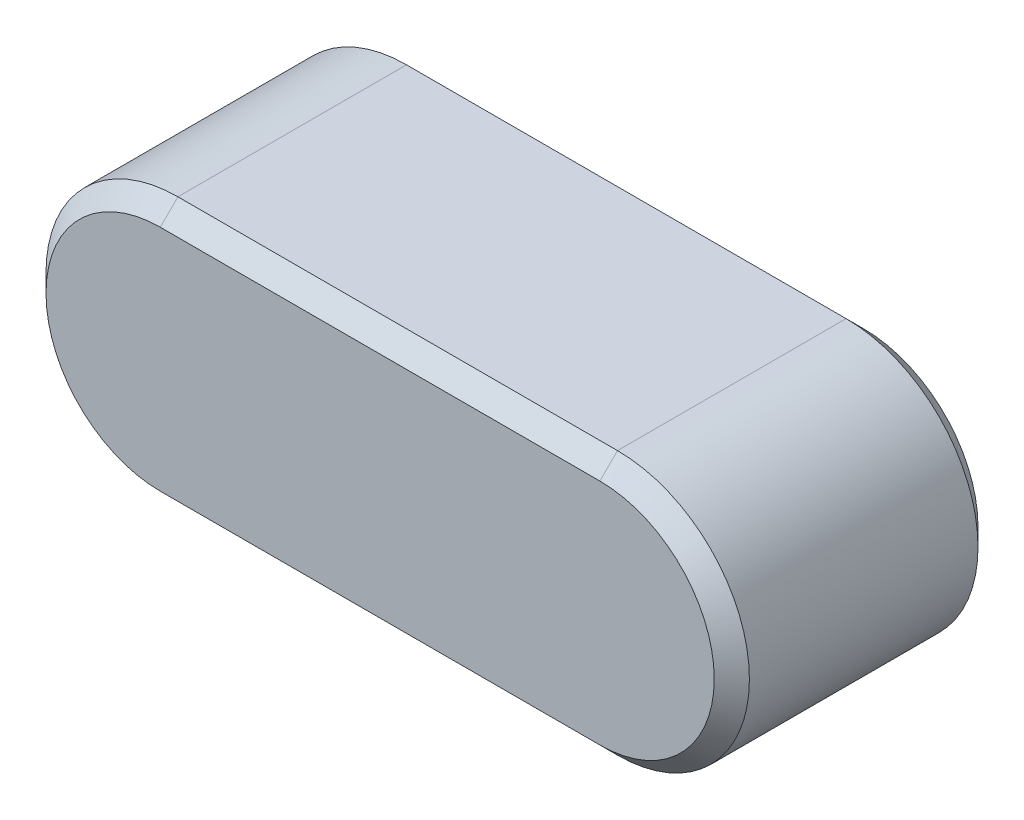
ISO-10303-21;
HEADER;
FILE_DESCRIPTION(('STEP AP214'),'2;1');
FILE_NAME('part.step','',(''),(''),'','','');
FILE_SCHEMA(('AUTOMOTIVE_DESIGN { 1 0 10303 214 1 1 1 1 }'));
ENDSEC;
DATA;
#1=APPLICATION_CONTEXT('core data for automotive mechanical design processes');
#2=APPLICATION_PROTOCOL_DEFINITION('international standard','automotive_design',2000,#1);
#3=PRODUCT_CONTEXT('',#1,'mechanical');
#4=PRODUCT('Part','Part','',(#3));
#5=PRODUCT_RELATED_PRODUCT_CATEGORY('part','',(#4));
#6=PRODUCT_DEFINITION_FORMATION('','',#4);
#7=PRODUCT_DEFINITION_CONTEXT('part definition',#1,'design');
#8=PRODUCT_DEFINITION('design','',#6,#7);
#9=PRODUCT_DEFINITION_SHAPE('','',#8);
#10=(LENGTH_UNIT() NAMED_UNIT(*) SI_UNIT(.MILLI.,.METRE.));
#11=(NAMED_UNIT(*) PLANE_ANGLE_UNIT() SI_UNIT($,.RADIAN.));
#12=(NAMED_UNIT(*) SI_UNIT($,.STERADIAN.) SOLID_ANGLE_UNIT());
#13=UNCERTAINTY_MEASURE_WITH_UNIT(LENGTH_MEASURE(1.E-05),#10,'distance_accuracy_value','');
#14=(GEOMETRIC_REPRESENTATION_CONTEXT(3) GLOBAL_UNCERTAINTY_ASSIGNED_CONTEXT((#13)) GLOBAL_UNIT_ASSIGNED_CONTEXT((#10,
#11,#12)) REPRESENTATION_CONTEXT('',''));
#15=CARTESIAN_POINT('',(0.,0.,0.));
#16=DIRECTION('',(0.,0.,1.));
#17=DIRECTION('',(1.,0.,0.));
#18=AXIS2_PLACEMENT_3D('',#15,#16,#17);
#19=CARTESIAN_POINT('',(-5.,0.,1.5));
#20=DIRECTION('',(0.,0.,-1.));
#21=DIRECTION('',(-1.,0.,0.));
#22=AXIS2_PLACEMENT_3D('',#19,#20,#21);
#23=CYLINDRICAL_SURFACE('',#22,1.5);
#24=DIRECTION('',(0.,0.,-1.));
#25=VECTOR('',#24,1.);
#26=CARTESIAN_POINT('',(-5.,-1.5,1.5));
#27=LINE('',#26,#25);
#28=CARTESIAN_POINT('',(-5.,-1.5,1.3));
#29=VERTEX_POINT('',#28);
#30=CARTESIAN_POINT('',(-5.,-1.5,-1.3));
#31=VERTEX_POINT('',#30);
#32=EDGE_CURVE('E128',#29,#31,#27,.T.);
#33=ORIENTED_EDGE('',*,*,#32,.F.);
#34=CARTESIAN_POINT('',(-5.,0.,1.3));
#35=DIRECTION('',(0.,0.,-1.));
#36=DIRECTION('',(-1.,0.,0.));
#37=AXIS2_PLACEMENT_3D('',#34,#35,#36);
#38=CIRCLE('',#37,1.5);
#39=CARTESIAN_POINT('',(-5.,1.5,1.3));
#40=VERTEX_POINT('',#39);
#41=EDGE_CURVE('E62',#29,#40,#38,.T.);
#42=ORIENTED_EDGE('',*,*,#41,.T.);
#43=DIRECTION('',(0.,0.,-1.));
#44=VECTOR('',#43,1.);
#45=CARTESIAN_POINT('',(-5.,1.5,1.5));
#46=LINE('',#45,#44);
#47=CARTESIAN_POINT('',(-5.,1.5,-1.3));
#48=VERTEX_POINT('',#47);
#49=EDGE_CURVE('E166',#40,#48,#46,.T.);
#50=ORIENTED_EDGE('',*,*,#49,.T.);
#51=CARTESIAN_POINT('',(-5.,0.,-1.3));
#52=DIRECTION('',(0.,0.,-1.));
#53=DIRECTION('',(-1.,0.,0.));
#54=AXIS2_PLACEMENT_3D('',#51,#52,#53);
#55=CIRCLE('',#54,1.5);
#56=EDGE_CURVE('E116',#48,#31,#55,.F.);
#57=ORIENTED_EDGE('',*,*,#56,.T.);
#58=EDGE_LOOP('',(#33,#42,#50,#57));
#59=FACE_BOUND('',#58,.T.);
#60=ADVANCED_FACE('F39',(#59),#23,.T.);
#61=CARTESIAN_POINT('',(0.,-1.5,1.5));
#62=DIRECTION('',(0.,1.,0.));
#63=DIRECTION('',(-1.,0.,0.));
#64=AXIS2_PLACEMENT_3D('',#61,#62,#63);
#65=PLANE('',#64);
#66=ORIENTED_EDGE('',*,*,#32,.T.);
#67=DIRECTION('',(1.,0.,0.));
#68=VECTOR('',#67,1.);
#69=CARTESIAN_POINT('',(0.,-1.5,-1.3));
#70=LINE('',#69,#68);
#71=CARTESIAN_POINT('',(0.,-1.5,-1.3));
#72=VERTEX_POINT('',#71);
#73=EDGE_CURVE('E127',#31,#72,#70,.T.);
#74=ORIENTED_EDGE('',*,*,#73,.T.);
#75=DIRECTION('',(0.,0.,-1.));
#76=VECTOR('',#75,1.);
#77=CARTESIAN_POINT('',(0.,-1.5,1.5));
#78=LINE('',#77,#76);
#79=CARTESIAN_POINT('',(0.,-1.5,1.3));
#80=VERTEX_POINT('',#79);
#81=EDGE_CURVE('E110',#80,#72,#78,.T.);
#82=ORIENTED_EDGE('',*,*,#81,.F.);
#83=DIRECTION('',(-1.,0.,0.));
#84=VECTOR('',#83,1.);
#85=CARTESIAN_POINT('',(0.,-1.5,1.3));
#86=LINE('',#85,#84);
#87=EDGE_CURVE('E125',#80,#29,#86,.T.);
#88=ORIENTED_EDGE('',*,*,#87,.T.);
#89=EDGE_LOOP('',(#66,#74,#82,#88));
#90=FACE_BOUND('',#89,.T.);
#91=ADVANCED_FACE('F124',(#90),#65,.F.);
#92=CARTESIAN_POINT('',(0.,0.,1.5));
#93=DIRECTION('',(0.,0.,-1.));
#94=DIRECTION('',(-1.,0.,0.));
#95=AXIS2_PLACEMENT_3D('',#92,#93,#94);
#96=CYLINDRICAL_SURFACE('',#95,1.5);
#97=DIRECTION('',(0.,0.,-1.));
#98=VECTOR('',#97,1.);
#99=CARTESIAN_POINT('',(0.,1.5,1.5));
#100=LINE('',#99,#98);
#101=CARTESIAN_POINT('',(0.,1.5,1.3));
#102=VERTEX_POINT('',#101);
#103=CARTESIAN_POINT('',(0.,1.5,-1.3));
#104=VERTEX_POINT('',#103);
#105=EDGE_CURVE('E111',#102,#104,#100,.T.);
#106=ORIENTED_EDGE('',*,*,#105,.F.);
#107=CARTESIAN_POINT('',(0.,0.,1.3));
#108=DIRECTION('',(0.,0.,-1.));
#109=DIRECTION('',(-1.,0.,0.));
#110=AXIS2_PLACEMENT_3D('',#107,#108,#109);
#111=CIRCLE('',#110,1.5);
#112=EDGE_CURVE('E107',#102,#80,#111,.T.);
#113=ORIENTED_EDGE('',*,*,#112,.T.);
#114=ORIENTED_EDGE('',*,*,#81,.T.);
#115=CARTESIAN_POINT('',(0.,0.,-1.3));
#116=DIRECTION('',(0.,0.,-1.));
#117=DIRECTION('',(-1.,0.,0.));
#118=AXIS2_PLACEMENT_3D('',#115,#116,#117);
#119=CIRCLE('',#118,1.5);
#120=EDGE_CURVE('E117',#72,#104,#119,.F.);
#121=ORIENTED_EDGE('',*,*,#120,.T.);
#122=EDGE_LOOP('',(#106,#113,#114,#121));
#123=FACE_BOUND('',#122,.T.);
#124=ADVANCED_FACE('F109',(#123),#96,.T.);
#125=CARTESIAN_POINT('',(-5.,1.5,1.5));
#126=DIRECTION('',(0.,-1.,0.));
#127=DIRECTION('',(0.,0.,-1.));
#128=AXIS2_PLACEMENT_3D('',#125,#126,#127);
#129=PLANE('',#128);
#130=ORIENTED_EDGE('',*,*,#49,.F.);
#131=DIRECTION('',(1.,0.,0.));
#132=VECTOR('',#131,1.);
#133=CARTESIAN_POINT('',(-5.,1.5,1.3));
#134=LINE('',#133,#132);
#135=EDGE_CURVE('E11',#40,#102,#134,.T.);
#136=ORIENTED_EDGE('',*,*,#135,.T.);
#137=ORIENTED_EDGE('',*,*,#105,.T.);
#138=DIRECTION('',(-1.,0.,0.));
#139=VECTOR('',#138,1.);
#140=CARTESIAN_POINT('',(-5.,1.5,-1.3));
#141=LINE('',#140,#139);
#142=EDGE_CURVE('E48',#104,#48,#141,.T.);
#143=ORIENTED_EDGE('',*,*,#142,.T.);
#144=EDGE_LOOP('',(#130,#136,#137,#143));
#145=FACE_BOUND('',#144,.T.);
#146=ADVANCED_FACE('F216',(#145),#129,.F.);
#147=CARTESIAN_POINT('',(-5.,0.,1.5));
#148=DIRECTION('',(0.,0.,-1.));
#149=DIRECTION('',(-1.,0.,0.));
#150=AXIS2_PLACEMENT_3D('',#147,#148,#149);
#151=PLANE('',#150);
#152=CARTESIAN_POINT('',(-5.,0.,1.5));
#153=DIRECTION('',(0.,0.,-1.));
#154=DIRECTION('',(-1.,0.,0.));
#155=AXIS2_PLACEMENT_3D('',#152,#153,#154);
#156=CIRCLE('',#155,1.3);
#157=CARTESIAN_POINT('',(-5.,1.3,1.5));
#158=VERTEX_POINT('',#157);
#159=CARTESIAN_POINT('',(-5.,-1.3,1.5));
#160=VERTEX_POINT('',#159);
#161=EDGE_CURVE('E187',#158,#160,#156,.F.);
#162=ORIENTED_EDGE('',*,*,#161,.T.);
#163=DIRECTION('',(1.,0.,0.));
#164=VECTOR('',#163,1.);
#165=CARTESIAN_POINT('',(-5.,-1.3,1.5));
#166=LINE('',#165,#164);
#167=CARTESIAN_POINT('',(0.,-1.3,1.5));
#168=VERTEX_POINT('',#167);
#169=EDGE_CURVE('E190',#160,#168,#166,.T.);
#170=ORIENTED_EDGE('',*,*,#169,.T.);
#171=CARTESIAN_POINT('',(0.,0.,1.5));
#172=DIRECTION('',(0.,0.,-1.));
#173=DIRECTION('',(-1.,0.,0.));
#174=AXIS2_PLACEMENT_3D('',#171,#172,#173);
#175=CIRCLE('',#174,1.3);
#176=CARTESIAN_POINT('',(0.,1.3,1.5));
#177=VERTEX_POINT('',#176);
#178=EDGE_CURVE('E139',#168,#177,#175,.F.);
#179=ORIENTED_EDGE('',*,*,#178,.T.);
#180=DIRECTION('',(-1.,0.,0.));
#181=VECTOR('',#180,1.);
#182=CARTESIAN_POINT('',(-5.,1.3,1.5));
#183=LINE('',#182,#181);
#184=EDGE_CURVE('E185',#177,#158,#183,.T.);
#185=ORIENTED_EDGE('',*,*,#184,.T.);
#186=EDGE_LOOP('',(#162,#170,#179,#185));
#187=FACE_BOUND('',#186,.T.);
#188=ADVANCED_FACE('F219',(#187),#151,.F.);
#189=CARTESIAN_POINT('',(-5.,0.,-1.5));
#190=DIRECTION('',(0.,0.,-1.));
#191=DIRECTION('',(-1.,0.,0.));
#192=AXIS2_PLACEMENT_3D('',#189,#190,#191);
#193=PLANE('',#192);
#194=CARTESIAN_POINT('',(0.,0.,-1.5));
#195=DIRECTION('',(0.,0.,-1.));
#196=DIRECTION('',(-1.,0.,0.));
#197=AXIS2_PLACEMENT_3D('',#194,#195,#196);
#198=CIRCLE('',#197,1.3);
#199=CARTESIAN_POINT('',(0.,1.3,-1.5));
#200=VERTEX_POINT('',#199);
#201=CARTESIAN_POINT('',(0.,-1.3,-1.5));
#202=VERTEX_POINT('',#201);
#203=EDGE_CURVE('E180',#200,#202,#198,.T.);
#204=ORIENTED_EDGE('',*,*,#203,.T.);
#205=DIRECTION('',(-1.,0.,0.));
#206=VECTOR('',#205,1.);
#207=CARTESIAN_POINT('',(-5.,-1.3,-1.5));
#208=LINE('',#207,#206);
#209=CARTESIAN_POINT('',(-5.,-1.3,-1.5));
#210=VERTEX_POINT('',#209);
#211=EDGE_CURVE('E182',#202,#210,#208,.T.);
#212=ORIENTED_EDGE('',*,*,#211,.T.);
#213=CARTESIAN_POINT('',(-5.,0.,-1.5));
#214=DIRECTION('',(0.,0.,-1.));
#215=DIRECTION('',(-1.,0.,0.));
#216=AXIS2_PLACEMENT_3D('',#213,#214,#215);
#217=CIRCLE('',#216,1.3);
#218=CARTESIAN_POINT('',(-5.,1.3,-1.5));
#219=VERTEX_POINT('',#218);
#220=EDGE_CURVE('E178',#210,#219,#217,.T.);
#221=ORIENTED_EDGE('',*,*,#220,.T.);
#222=DIRECTION('',(1.,0.,0.));
#223=VECTOR('',#222,1.);
#224=CARTESIAN_POINT('',(0.,1.3,-1.5));
#225=LINE('',#224,#223);
#226=EDGE_CURVE('E176',#219,#200,#225,.T.);
#227=ORIENTED_EDGE('',*,*,#226,.T.);
#228=EDGE_LOOP('',(#204,#212,#221,#227));
#229=FACE_BOUND('',#228,.T.);
#230=ADVANCED_FACE('F220',(#229),#193,.T.);
#231=CARTESIAN_POINT('',(-5.,1.5,-1.3));
#232=DIRECTION('',(0.,0.707106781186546,-0.707106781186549));
#233=DIRECTION('',(0.,0.707106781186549,0.707106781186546));
#234=AXIS2_PLACEMENT_3D('',#231,#232,#233);
#235=PLANE('',#234);
#236=DIRECTION('',(0.,0.707106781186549,0.707106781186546));
#237=VECTOR('',#236,1.);
#238=CARTESIAN_POINT('',(0.,1.3,-1.5));
#239=LINE('',#238,#237);
#240=EDGE_CURVE('E158',#200,#104,#239,.T.);
#241=ORIENTED_EDGE('',*,*,#240,.F.);
#242=ORIENTED_EDGE('',*,*,#226,.F.);
#243=DIRECTION('',(0.,-0.707106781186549,-0.707106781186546));
#244=VECTOR('',#243,1.);
#245=CARTESIAN_POINT('',(-5.,1.5,-1.3));
#246=LINE('',#245,#244);
#247=EDGE_CURVE('E145',#48,#219,#246,.T.);
#248=ORIENTED_EDGE('',*,*,#247,.F.);
#249=ORIENTED_EDGE('',*,*,#142,.F.);
#250=EDGE_LOOP('',(#241,#242,#248,#249));
#251=FACE_BOUND('',#250,.T.);
#252=ADVANCED_FACE('F223',(#251),#235,.T.);
#253=CARTESIAN_POINT('',(-5.,0.,-1.3));
#254=DIRECTION('',(0.,0.,1.));
#255=DIRECTION('',(1.,0.,0.));
#256=AXIS2_PLACEMENT_3D('',#253,#254,#255);
#257=CONICAL_SURFACE('',#256,1.5,0.78539816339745);
#258=ORIENTED_EDGE('',*,*,#247,.T.);
#259=ORIENTED_EDGE('',*,*,#220,.F.);
#260=DIRECTION('',(0.,0.707106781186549,-0.707106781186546));
#261=VECTOR('',#260,1.);
#262=CARTESIAN_POINT('',(-5.,-1.5,-1.3));
#263=LINE('',#262,#261);
#264=EDGE_CURVE('E152',#31,#210,#263,.T.);
#265=ORIENTED_EDGE('',*,*,#264,.F.);
#266=ORIENTED_EDGE('',*,*,#56,.F.);
#267=EDGE_LOOP('',(#258,#259,#265,#266));
#268=FACE_BOUND('',#267,.T.);
#269=ADVANCED_FACE('F195',(#268),#257,.T.);
#270=CARTESIAN_POINT('',(0.,0.,-1.3));
#271=DIRECTION('',(0.,0.,1.));
#272=DIRECTION('',(1.,0.,0.));
#273=AXIS2_PLACEMENT_3D('',#270,#271,#272);
#274=CONICAL_SURFACE('',#273,1.5,0.78539816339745);
#275=ORIENTED_EDGE('',*,*,#240,.T.);
#276=ORIENTED_EDGE('',*,*,#120,.F.);
#277=DIRECTION('',(0.,-0.707106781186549,0.707106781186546));
#278=VECTOR('',#277,1.);
#279=CARTESIAN_POINT('',(0.,-1.3,-1.5));
#280=LINE('',#279,#278);
#281=EDGE_CURVE('E148',#202,#72,#280,.T.);
#282=ORIENTED_EDGE('',*,*,#281,.F.);
#283=ORIENTED_EDGE('',*,*,#203,.F.);
#284=EDGE_LOOP('',(#275,#276,#282,#283));
#285=FACE_BOUND('',#284,.T.);
#286=ADVANCED_FACE('F198',(#285),#274,.T.);
#287=CARTESIAN_POINT('',(0.,-1.5,-1.3));
#288=DIRECTION('',(0.,-0.707106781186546,-0.707106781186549));
#289=DIRECTION('',(0.,0.707106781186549,-0.707106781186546));
#290=AXIS2_PLACEMENT_3D('',#287,#288,#289);
#291=PLANE('',#290);
#292=ORIENTED_EDGE('',*,*,#264,.T.);
#293=ORIENTED_EDGE('',*,*,#211,.F.);
#294=ORIENTED_EDGE('',*,*,#281,.T.);
#295=ORIENTED_EDGE('',*,*,#73,.F.);
#296=EDGE_LOOP('',(#292,#293,#294,#295));
#297=FACE_BOUND('',#296,.T.);
#298=ADVANCED_FACE('F196',(#297),#291,.T.);
#299=CARTESIAN_POINT('',(-5.,1.3,1.5));
#300=DIRECTION('',(0.,-0.707106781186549,-0.707106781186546));
#301=DIRECTION('',(0.,0.707106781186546,-0.707106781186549));
#302=AXIS2_PLACEMENT_3D('',#299,#300,#301);
#303=PLANE('',#302);
#304=DIRECTION('',(0.,-0.707106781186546,0.707106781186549));
#305=VECTOR('',#304,1.);
#306=CARTESIAN_POINT('',(0.,1.5,1.3));
#307=LINE('',#306,#305);
#308=EDGE_CURVE('E142',#102,#177,#307,.T.);
#309=ORIENTED_EDGE('',*,*,#308,.F.);
#310=ORIENTED_EDGE('',*,*,#135,.F.);
#311=DIRECTION('',(0.,0.707106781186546,-0.707106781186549));
#312=VECTOR('',#311,1.);
#313=CARTESIAN_POINT('',(-5.,1.3,1.5));
#314=LINE('',#313,#312);
#315=EDGE_CURVE('E43',#158,#40,#314,.T.);
#316=ORIENTED_EDGE('',*,*,#315,.F.);
#317=ORIENTED_EDGE('',*,*,#184,.F.);
#318=EDGE_LOOP('',(#309,#310,#316,#317));
#319=FACE_BOUND('',#318,.T.);
#320=ADVANCED_FACE('F41',(#319),#303,.F.);
#321=CARTESIAN_POINT('',(-5.,0.,1.5));
#322=DIRECTION('',(0.,0.,-1.));
#323=DIRECTION('',(-1.,0.,0.));
#324=AXIS2_PLACEMENT_3D('',#321,#322,#323);
#325=CONICAL_SURFACE('',#324,1.3,0.785398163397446);
#326=ORIENTED_EDGE('',*,*,#315,.T.);
#327=ORIENTED_EDGE('',*,*,#41,.F.);
#328=DIRECTION('',(0.,-0.707106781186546,-0.707106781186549));
#329=VECTOR('',#328,1.);
#330=CARTESIAN_POINT('',(-5.,-1.3,1.5));
#331=LINE('',#330,#329);
#332=EDGE_CURVE('E136',#160,#29,#331,.T.);
#333=ORIENTED_EDGE('',*,*,#332,.F.);
#334=ORIENTED_EDGE('',*,*,#161,.F.);
#335=EDGE_LOOP('',(#326,#327,#333,#334));
#336=FACE_BOUND('',#335,.T.);
#337=ADVANCED_FACE('F204',(#336),#325,.T.);
#338=CARTESIAN_POINT('',(0.,0.,1.5));
#339=DIRECTION('',(0.,0.,-1.));
#340=DIRECTION('',(-1.,0.,0.));
#341=AXIS2_PLACEMENT_3D('',#338,#339,#340);
#342=CONICAL_SURFACE('',#341,1.3,0.785398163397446);
#343=ORIENTED_EDGE('',*,*,#308,.T.);
#344=ORIENTED_EDGE('',*,*,#178,.F.);
#345=DIRECTION('',(0.,0.707106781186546,0.707106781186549));
#346=VECTOR('',#345,1.);
#347=CARTESIAN_POINT('',(0.,-1.5,1.3));
#348=LINE('',#347,#346);
#349=EDGE_CURVE('E133',#80,#168,#348,.T.);
#350=ORIENTED_EDGE('',*,*,#349,.F.);
#351=ORIENTED_EDGE('',*,*,#112,.F.);
#352=EDGE_LOOP('',(#343,#344,#350,#351));
#353=FACE_BOUND('',#352,.T.);
#354=ADVANCED_FACE('F138',(#353),#342,.T.);
#355=CARTESIAN_POINT('',(-5.,-1.3,1.5));
#356=DIRECTION('',(0.,0.707106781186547,-0.707106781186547));
#357=DIRECTION('',(0.,0.707106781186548,0.707106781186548));
#358=AXIS2_PLACEMENT_3D('',#355,#356,#357);
#359=PLANE('',#358);
#360=ORIENTED_EDGE('',*,*,#332,.T.);
#361=ORIENTED_EDGE('',*,*,#87,.F.);
#362=ORIENTED_EDGE('',*,*,#349,.T.);
#363=ORIENTED_EDGE('',*,*,#169,.F.);
#364=EDGE_LOOP('',(#360,#361,#362,#363));
#365=FACE_BOUND('',#364,.T.);
#366=ADVANCED_FACE('F131',(#365),#359,.F.);
#367=CLOSED_SHELL('',(#60,#91,#124,#146,#188,#230,#252,#269,#286,#298,#320,#337,#354,#366));
#368=MANIFOLD_SOLID_BREP('B2',#367);
#369=ADVANCED_BREP_SHAPE_REPRESENTATION('',(#18,#368),#14);
#370=SHAPE_DEFINITION_REPRESENTATION(#9,#369);
ENDSEC;
END-ISO-10303-21;
